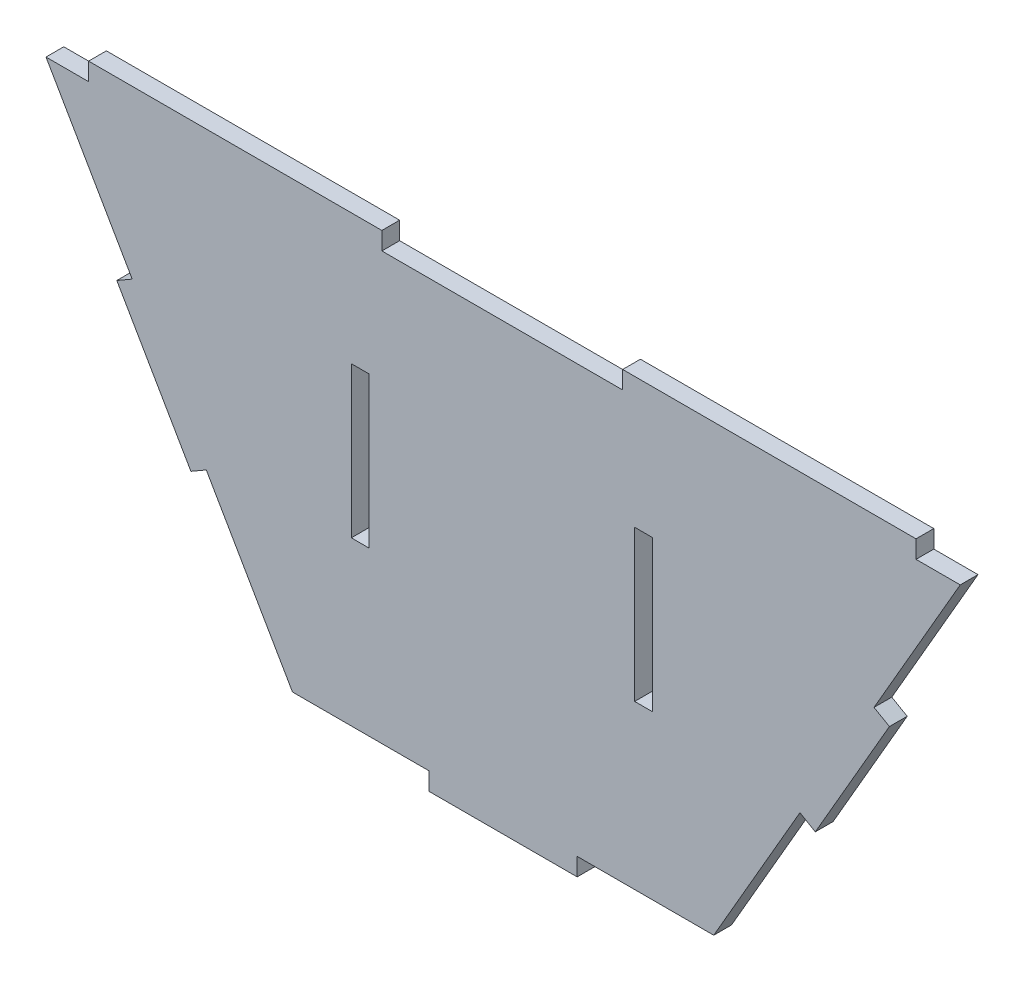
ISO-10303-21;
HEADER;
FILE_DESCRIPTION(('STEP AP214'),'2;1');
FILE_NAME('part.step','',(''),(''),'','','');
FILE_SCHEMA(('AUTOMOTIVE_DESIGN { 1 0 10303 214 1 1 1 1 }'));
ENDSEC;
DATA;
#1=APPLICATION_CONTEXT('core data for automotive mechanical design processes');
#2=APPLICATION_PROTOCOL_DEFINITION('international standard','automotive_design',2000,#1);
#3=PRODUCT_CONTEXT('',#1,'mechanical');
#4=PRODUCT('Part','Part','',(#3));
#5=PRODUCT_RELATED_PRODUCT_CATEGORY('part','',(#4));
#6=PRODUCT_DEFINITION_FORMATION('','',#4);
#7=PRODUCT_DEFINITION_CONTEXT('part definition',#1,'design');
#8=PRODUCT_DEFINITION('design','',#6,#7);
#9=PRODUCT_DEFINITION_SHAPE('','',#8);
#10=(LENGTH_UNIT() NAMED_UNIT(*) SI_UNIT(.MILLI.,.METRE.));
#11=(NAMED_UNIT(*) PLANE_ANGLE_UNIT() SI_UNIT($,.RADIAN.));
#12=(NAMED_UNIT(*) SI_UNIT($,.STERADIAN.) SOLID_ANGLE_UNIT());
#13=UNCERTAINTY_MEASURE_WITH_UNIT(LENGTH_MEASURE(1.E-05),#10,'distance_accuracy_value','');
#14=(GEOMETRIC_REPRESENTATION_CONTEXT(3) GLOBAL_UNCERTAINTY_ASSIGNED_CONTEXT((#13)) GLOBAL_UNIT_ASSIGNED_CONTEXT((#10,
#11,#12)) REPRESENTATION_CONTEXT('',''));
#15=CARTESIAN_POINT('',(0.,0.,0.));
#16=DIRECTION('',(0.,0.,1.));
#17=DIRECTION('',(1.,0.,0.));
#18=AXIS2_PLACEMENT_3D('',#15,#16,#17);
#19=CARTESIAN_POINT('',(0.,0.,1.524));
#20=DIRECTION('',(0.,0.,1.));
#21=DIRECTION('',(1.,0.,0.));
#22=AXIS2_PLACEMENT_3D('',#19,#20,#21);
#23=PLANE('',#22);
#24=DIRECTION('',(1.,0.,0.));
#25=VECTOR('',#24,1.);
#26=CARTESIAN_POINT('',(-13.0154243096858,-22.6139078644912,1.524));
#27=LINE('',#26,#25);
#28=CARTESIAN_POINT('',(-13.0154243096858,-22.6139078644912,1.524));
#29=VERTEX_POINT('',#28);
#30=CARTESIAN_POINT('',(-11.4914243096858,-22.6139078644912,1.524));
#31=VERTEX_POINT('',#30);
#32=EDGE_CURVE('E281',#29,#31,#27,.T.);
#33=ORIENTED_EDGE('',*,*,#32,.F.);
#34=DIRECTION('',(0.,-1.,0.));
#35=VECTOR('',#34,1.);
#36=CARTESIAN_POINT('',(-13.0154243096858,-22.6139078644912,1.524));
#37=LINE('',#36,#35);
#38=CARTESIAN_POINT('',(-13.0154243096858,-9.67997937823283,1.524));
#39=VERTEX_POINT('',#38);
#40=EDGE_CURVE('E279',#39,#29,#37,.T.);
#41=ORIENTED_EDGE('',*,*,#40,.F.);
#42=DIRECTION('',(-1.,0.,0.));
#43=VECTOR('',#42,1.);
#44=CARTESIAN_POINT('',(-13.0154243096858,-9.67997937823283,1.524));
#45=LINE('',#44,#43);
#46=CARTESIAN_POINT('',(-11.4914243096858,-9.67997937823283,1.524));
#47=VERTEX_POINT('',#46);
#48=EDGE_CURVE('E287',#47,#39,#45,.T.);
#49=ORIENTED_EDGE('',*,*,#48,.F.);
#50=DIRECTION('',(0.,1.,0.));
#51=VECTOR('',#50,1.);
#52=CARTESIAN_POINT('',(-11.4914243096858,-22.6139078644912,1.524));
#53=LINE('',#52,#51);
#54=EDGE_CURVE('E284',#31,#47,#53,.T.);
#55=ORIENTED_EDGE('',*,*,#54,.F.);
#56=EDGE_LOOP('',(#33,#41,#49,#55));
#57=FACE_BOUND('',#56,.T.);
#58=DIRECTION('',(-1.,0.,0.));
#59=VECTOR('',#58,1.);
#60=CARTESIAN_POINT('',(-35.5427068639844,0.,1.524));
#61=LINE('',#60,#59);
#62=CARTESIAN_POINT('',(-35.5427068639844,0.,1.524));
#63=VERTEX_POINT('',#62);
#64=CARTESIAN_POINT('',(-39.1954700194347,0.,1.524));
#65=VERTEX_POINT('',#64);
#66=EDGE_CURVE('E310',#63,#65,#61,.T.);
#67=ORIENTED_EDGE('',*,*,#66,.T.);
#68=DIRECTION('',(0.500229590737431,-0.865892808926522,0.));
#69=VECTOR('',#68,1.);
#70=CARTESIAN_POINT('',(-39.1954700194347,0.,1.524));
#71=LINE('',#70,#69);
#72=CARTESIAN_POINT('',(-31.8042349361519,-12.7941597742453,1.524));
#73=VERTEX_POINT('',#72);
#74=EDGE_CURVE('E313',#65,#73,#71,.T.);
#75=ORIENTED_EDGE('',*,*,#74,.T.);
#76=DIRECTION('',(-0.865892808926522,-0.50022959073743,0.));
#77=VECTOR('',#76,1.);
#78=CARTESIAN_POINT('',(-31.8042349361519,-12.7941597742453,1.524));
#79=LINE('',#78,#77);
#80=CARTESIAN_POINT('',(-33.1238555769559,-13.5565096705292,1.524));
#81=VERTEX_POINT('',#80);
#82=EDGE_CURVE('E316',#73,#81,#79,.T.);
#83=ORIENTED_EDGE('',*,*,#82,.T.);
#84=DIRECTION('',(0.500229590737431,-0.865892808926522,0.));
#85=VECTOR('',#84,1.);
#86=CARTESIAN_POINT('',(-33.1238555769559,-13.5565096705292,1.524));
#87=LINE('',#86,#85);
#88=CARTESIAN_POINT('',(-26.7709397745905,-24.553348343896,1.524));
#89=VERTEX_POINT('',#88);
#90=EDGE_CURVE('E318',#81,#89,#87,.T.);
#91=ORIENTED_EDGE('',*,*,#90,.T.);
#92=DIRECTION('',(0.865892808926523,0.50022959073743,0.));
#93=VECTOR('',#92,1.);
#94=CARTESIAN_POINT('',(-25.4513191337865,-23.7909984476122,1.524));
#95=LINE('',#94,#93);
#96=CARTESIAN_POINT('',(-25.4513191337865,-23.7909984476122,1.524));
#97=VERTEX_POINT('',#96);
#98=EDGE_CURVE('E320',#89,#97,#95,.T.);
#99=ORIENTED_EDGE('',*,*,#98,.T.);
#100=DIRECTION('',(0.500229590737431,-0.865892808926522,0.));
#101=VECTOR('',#100,1.);
#102=CARTESIAN_POINT('',(-25.4513191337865,-23.7909984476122,1.524));
#103=LINE('',#102,#101);
#104=CARTESIAN_POINT('',(-18.0600840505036,-36.5851582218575,1.524));
#105=VERTEX_POINT('',#104);
#106=EDGE_CURVE('E322',#97,#105,#103,.T.);
#107=ORIENTED_EDGE('',*,*,#106,.T.);
#108=DIRECTION('',(1.,0.,0.));
#109=VECTOR('',#108,1.);
#110=CARTESIAN_POINT('',(-18.0600840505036,-36.5851582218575,1.524));
#111=LINE('',#110,#109);
#112=CARTESIAN_POINT('',(-6.35,-36.5851582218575,1.524));
#113=VERTEX_POINT('',#112);
#114=EDGE_CURVE('E324',#105,#113,#111,.T.);
#115=ORIENTED_EDGE('',*,*,#114,.T.);
#116=DIRECTION('',(0.,-1.,0.));
#117=VECTOR('',#116,1.);
#118=CARTESIAN_POINT('',(-6.35,-36.5851582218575,1.524));
#119=LINE('',#118,#117);
#120=CARTESIAN_POINT('',(-6.35,-38.1091582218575,1.524));
#121=VERTEX_POINT('',#120);
#122=EDGE_CURVE('E326',#113,#121,#119,.T.);
#123=ORIENTED_EDGE('',*,*,#122,.T.);
#124=DIRECTION('',(1.,0.,0.));
#125=VECTOR('',#124,1.);
#126=CARTESIAN_POINT('',(-6.35,-38.1091582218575,1.524));
#127=LINE('',#126,#125);
#128=CARTESIAN_POINT('',(6.35,-38.1091582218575,1.524));
#129=VERTEX_POINT('',#128);
#130=EDGE_CURVE('E328',#121,#129,#127,.T.);
#131=ORIENTED_EDGE('',*,*,#130,.T.);
#132=DIRECTION('',(0.,1.,0.));
#133=VECTOR('',#132,1.);
#134=CARTESIAN_POINT('',(6.35,-36.5851582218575,1.524));
#135=LINE('',#134,#133);
#136=CARTESIAN_POINT('',(6.35,-36.5851582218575,1.524));
#137=VERTEX_POINT('',#136);
#138=EDGE_CURVE('E330',#129,#137,#135,.T.);
#139=ORIENTED_EDGE('',*,*,#138,.T.);
#140=DIRECTION('',(1.,0.,0.));
#141=VECTOR('',#140,1.);
#142=CARTESIAN_POINT('',(6.35,-36.5851582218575,1.524));
#143=LINE('',#142,#141);
#144=CARTESIAN_POINT('',(18.0600840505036,-36.5851582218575,1.524));
#145=VERTEX_POINT('',#144);
#146=EDGE_CURVE('E332',#137,#145,#143,.T.);
#147=ORIENTED_EDGE('',*,*,#146,.T.);
#148=DIRECTION('',(0.500229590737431,0.865892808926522,0.));
#149=VECTOR('',#148,1.);
#150=CARTESIAN_POINT('',(25.4513191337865,-23.7909984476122,1.524));
#151=LINE('',#150,#149);
#152=CARTESIAN_POINT('',(25.4513191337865,-23.7909984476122,1.524));
#153=VERTEX_POINT('',#152);
#154=EDGE_CURVE('E334',#145,#153,#151,.T.);
#155=ORIENTED_EDGE('',*,*,#154,.T.);
#156=DIRECTION('',(0.865892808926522,-0.500229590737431,0.));
#157=VECTOR('',#156,1.);
#158=CARTESIAN_POINT('',(25.4513191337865,-23.7909984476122,1.524));
#159=LINE('',#158,#157);
#160=CARTESIAN_POINT('',(26.7709397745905,-24.553348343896,1.524));
#161=VERTEX_POINT('',#160);
#162=EDGE_CURVE('E336',#153,#161,#159,.T.);
#163=ORIENTED_EDGE('',*,*,#162,.T.);
#164=DIRECTION('',(0.500229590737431,0.865892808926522,0.));
#165=VECTOR('',#164,1.);
#166=CARTESIAN_POINT('',(26.7709397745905,-24.553348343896,1.524));
#167=LINE('',#166,#165);
#168=CARTESIAN_POINT('',(33.1238555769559,-13.5565096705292,1.524));
#169=VERTEX_POINT('',#168);
#170=EDGE_CURVE('E338',#161,#169,#167,.T.);
#171=ORIENTED_EDGE('',*,*,#170,.T.);
#172=DIRECTION('',(-0.865892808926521,0.500229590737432,0.));
#173=VECTOR('',#172,1.);
#174=CARTESIAN_POINT('',(31.8042349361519,-12.7941597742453,1.524));
#175=LINE('',#174,#173);
#176=CARTESIAN_POINT('',(31.8042349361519,-12.7941597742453,1.524));
#177=VERTEX_POINT('',#176);
#178=EDGE_CURVE('E340',#169,#177,#175,.T.);
#179=ORIENTED_EDGE('',*,*,#178,.T.);
#180=DIRECTION('',(0.500229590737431,0.865892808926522,0.));
#181=VECTOR('',#180,1.);
#182=CARTESIAN_POINT('',(39.1954700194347,0.,1.524));
#183=LINE('',#182,#181);
#184=CARTESIAN_POINT('',(39.1954700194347,0.,1.524));
#185=VERTEX_POINT('',#184);
#186=EDGE_CURVE('E342',#177,#185,#183,.T.);
#187=ORIENTED_EDGE('',*,*,#186,.T.);
#188=DIRECTION('',(-1.,0.,0.));
#189=VECTOR('',#188,1.);
#190=CARTESIAN_POINT('',(35.4052426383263,0.,1.524));
#191=LINE('',#190,#189);
#192=CARTESIAN_POINT('',(35.4052426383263,0.,1.524));
#193=VERTEX_POINT('',#192);
#194=EDGE_CURVE('E344',#185,#193,#191,.T.);
#195=ORIENTED_EDGE('',*,*,#194,.T.);
#196=DIRECTION('',(0.,1.,0.));
#197=VECTOR('',#196,1.);
#198=CARTESIAN_POINT('',(35.4052426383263,0.,1.524));
#199=LINE('',#198,#197);
#200=CARTESIAN_POINT('',(35.4052426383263,1.524,1.524));
#201=VERTEX_POINT('',#200);
#202=EDGE_CURVE('E346',#193,#201,#199,.T.);
#203=ORIENTED_EDGE('',*,*,#202,.T.);
#204=DIRECTION('',(-1.,0.,0.));
#205=VECTOR('',#204,1.);
#206=CARTESIAN_POINT('',(10.2511639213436,1.524,1.524));
#207=LINE('',#206,#205);
#208=CARTESIAN_POINT('',(10.2511639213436,1.524,1.524));
#209=VERTEX_POINT('',#208);
#210=EDGE_CURVE('E348',#201,#209,#207,.T.);
#211=ORIENTED_EDGE('',*,*,#210,.T.);
#212=DIRECTION('',(0.,-1.,0.));
#213=VECTOR('',#212,1.);
#214=CARTESIAN_POINT('',(10.2511639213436,0.,1.524));
#215=LINE('',#214,#213);
#216=CARTESIAN_POINT('',(10.2511639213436,0.,1.524));
#217=VERTEX_POINT('',#216);
#218=EDGE_CURVE('E350',#209,#217,#215,.T.);
#219=ORIENTED_EDGE('',*,*,#218,.T.);
#220=DIRECTION('',(-1.,0.,0.));
#221=VECTOR('',#220,1.);
#222=CARTESIAN_POINT('',(-10.3967007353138,0.,1.524));
#223=LINE('',#222,#221);
#224=CARTESIAN_POINT('',(-10.3967007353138,0.,1.524));
#225=VERTEX_POINT('',#224);
#226=EDGE_CURVE('E352',#217,#225,#223,.T.);
#227=ORIENTED_EDGE('',*,*,#226,.T.);
#228=DIRECTION('',(0.,1.,0.));
#229=VECTOR('',#228,1.);
#230=CARTESIAN_POINT('',(-10.3967007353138,1.524,1.524));
#231=LINE('',#230,#229);
#232=CARTESIAN_POINT('',(-10.3967007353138,1.524,1.524));
#233=VERTEX_POINT('',#232);
#234=EDGE_CURVE('E354',#225,#233,#231,.T.);
#235=ORIENTED_EDGE('',*,*,#234,.T.);
#236=DIRECTION('',(-1.,0.,0.));
#237=VECTOR('',#236,1.);
#238=CARTESIAN_POINT('',(-35.5427068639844,1.524,1.524));
#239=LINE('',#238,#237);
#240=CARTESIAN_POINT('',(-35.5427068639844,1.524,1.524));
#241=VERTEX_POINT('',#240);
#242=EDGE_CURVE('E356',#233,#241,#239,.T.);
#243=ORIENTED_EDGE('',*,*,#242,.T.);
#244=DIRECTION('',(0.,-1.,0.));
#245=VECTOR('',#244,1.);
#246=CARTESIAN_POINT('',(-35.5427068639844,0.,1.524));
#247=LINE('',#246,#245);
#248=EDGE_CURVE('E358',#241,#63,#247,.T.);
#249=ORIENTED_EDGE('',*,*,#248,.T.);
#250=EDGE_LOOP('',(#67,#75,#83,#91,#99,#107,#115,#123,#131,#139,#147,#155,#163,#171,#179,#187,
#195,#203,#211,#219,#227,#235,#243,#249));
#251=FACE_BOUND('',#250,.T.);
#252=DIRECTION('',(0.,1.,0.));
#253=VECTOR('',#252,1.);
#254=CARTESIAN_POINT('',(12.8033190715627,-22.6139078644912,1.524));
#255=LINE('',#254,#253);
#256=CARTESIAN_POINT('',(12.8033190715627,-22.6139078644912,1.524));
#257=VERTEX_POINT('',#256);
#258=CARTESIAN_POINT('',(12.8033190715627,-9.67997937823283,1.524));
#259=VERTEX_POINT('',#258);
#260=EDGE_CURVE('E251',#257,#259,#255,.T.);
#261=ORIENTED_EDGE('',*,*,#260,.F.);
#262=DIRECTION('',(1.,0.,0.));
#263=VECTOR('',#262,1.);
#264=CARTESIAN_POINT('',(12.8033190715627,-22.6139078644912,1.524));
#265=LINE('',#264,#263);
#266=CARTESIAN_POINT('',(11.2793190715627,-22.6139078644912,1.524));
#267=VERTEX_POINT('',#266);
#268=EDGE_CURVE('E243',#267,#257,#265,.T.);
#269=ORIENTED_EDGE('',*,*,#268,.F.);
#270=DIRECTION('',(0.,-1.,0.));
#271=VECTOR('',#270,1.);
#272=CARTESIAN_POINT('',(11.2793190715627,-22.6139078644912,1.524));
#273=LINE('',#272,#271);
#274=CARTESIAN_POINT('',(11.2793190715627,-9.67997937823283,1.524));
#275=VERTEX_POINT('',#274);
#276=EDGE_CURVE('E265',#275,#267,#273,.T.);
#277=ORIENTED_EDGE('',*,*,#276,.F.);
#278=DIRECTION('',(-1.,0.,0.));
#279=VECTOR('',#278,1.);
#280=CARTESIAN_POINT('',(12.8033190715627,-9.67997937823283,1.524));
#281=LINE('',#280,#279);
#282=EDGE_CURVE('E263',#259,#275,#281,.T.);
#283=ORIENTED_EDGE('',*,*,#282,.F.);
#284=EDGE_LOOP('',(#261,#269,#277,#283));
#285=FACE_BOUND('',#284,.T.);
#286=ADVANCED_FACE('F34',(#57,#251,#285),#23,.T.);
#287=CARTESIAN_POINT('',(0.,0.,0.));
#288=DIRECTION('',(0.,0.,1.));
#289=DIRECTION('',(1.,0.,0.));
#290=AXIS2_PLACEMENT_3D('',#287,#288,#289);
#291=PLANE('',#290);
#292=DIRECTION('',(0.,-1.,0.));
#293=VECTOR('',#292,1.);
#294=CARTESIAN_POINT('',(-13.0154243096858,-22.6139078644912,0.));
#295=LINE('',#294,#293);
#296=CARTESIAN_POINT('',(-13.0154243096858,-9.67997937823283,0.));
#297=VERTEX_POINT('',#296);
#298=CARTESIAN_POINT('',(-13.0154243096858,-22.6139078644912,0.));
#299=VERTEX_POINT('',#298);
#300=EDGE_CURVE('E259',#297,#299,#295,.T.);
#301=ORIENTED_EDGE('',*,*,#300,.T.);
#302=DIRECTION('',(1.,0.,0.));
#303=VECTOR('',#302,1.);
#304=CARTESIAN_POINT('',(-13.0154243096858,-22.6139078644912,0.));
#305=LINE('',#304,#303);
#306=CARTESIAN_POINT('',(-11.4914243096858,-22.6139078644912,0.));
#307=VERTEX_POINT('',#306);
#308=EDGE_CURVE('E292',#299,#307,#305,.T.);
#309=ORIENTED_EDGE('',*,*,#308,.T.);
#310=DIRECTION('',(0.,1.,0.));
#311=VECTOR('',#310,1.);
#312=CARTESIAN_POINT('',(-11.4914243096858,-22.6139078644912,0.));
#313=LINE('',#312,#311);
#314=CARTESIAN_POINT('',(-11.4914243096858,-9.67997937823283,0.));
#315=VERTEX_POINT('',#314);
#316=EDGE_CURVE('E295',#307,#315,#313,.T.);
#317=ORIENTED_EDGE('',*,*,#316,.T.);
#318=DIRECTION('',(-1.,0.,0.));
#319=VECTOR('',#318,1.);
#320=CARTESIAN_POINT('',(-13.0154243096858,-9.67997937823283,0.));
#321=LINE('',#320,#319);
#322=EDGE_CURVE('E282',#315,#297,#321,.T.);
#323=ORIENTED_EDGE('',*,*,#322,.T.);
#324=EDGE_LOOP('',(#301,#309,#317,#323));
#325=FACE_BOUND('',#324,.T.);
#326=DIRECTION('',(-1.,0.,0.));
#327=VECTOR('',#326,1.);
#328=CARTESIAN_POINT('',(-35.5427068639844,0.,0.));
#329=LINE('',#328,#327);
#330=CARTESIAN_POINT('',(-35.5427068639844,0.,0.));
#331=VERTEX_POINT('',#330);
#332=CARTESIAN_POINT('',(-39.1954700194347,0.,0.));
#333=VERTEX_POINT('',#332);
#334=EDGE_CURVE('E309',#331,#333,#329,.T.);
#335=ORIENTED_EDGE('',*,*,#334,.F.);
#336=DIRECTION('',(0.,-1.,0.));
#337=VECTOR('',#336,1.);
#338=CARTESIAN_POINT('',(-35.5427068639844,0.,0.));
#339=LINE('',#338,#337);
#340=CARTESIAN_POINT('',(-35.5427068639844,1.524,0.));
#341=VERTEX_POINT('',#340);
#342=EDGE_CURVE('E314',#341,#331,#339,.T.);
#343=ORIENTED_EDGE('',*,*,#342,.F.);
#344=DIRECTION('',(-1.,0.,0.));
#345=VECTOR('',#344,1.);
#346=CARTESIAN_POINT('',(-35.5427068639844,1.524,0.));
#347=LINE('',#346,#345);
#348=CARTESIAN_POINT('',(-10.3967007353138,1.524,0.));
#349=VERTEX_POINT('',#348);
#350=EDGE_CURVE('E405',#349,#341,#347,.T.);
#351=ORIENTED_EDGE('',*,*,#350,.F.);
#352=DIRECTION('',(0.,1.,0.));
#353=VECTOR('',#352,1.);
#354=CARTESIAN_POINT('',(-10.3967007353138,1.524,0.));
#355=LINE('',#354,#353);
#356=CARTESIAN_POINT('',(-10.3967007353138,0.,0.));
#357=VERTEX_POINT('',#356);
#358=EDGE_CURVE('E403',#357,#349,#355,.T.);
#359=ORIENTED_EDGE('',*,*,#358,.F.);
#360=DIRECTION('',(-1.,0.,0.));
#361=VECTOR('',#360,1.);
#362=CARTESIAN_POINT('',(-10.3967007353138,0.,0.));
#363=LINE('',#362,#361);
#364=CARTESIAN_POINT('',(10.2511639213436,0.,0.));
#365=VERTEX_POINT('',#364);
#366=EDGE_CURVE('E401',#365,#357,#363,.T.);
#367=ORIENTED_EDGE('',*,*,#366,.F.);
#368=DIRECTION('',(0.,-1.,0.));
#369=VECTOR('',#368,1.);
#370=CARTESIAN_POINT('',(10.2511639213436,0.,0.));
#371=LINE('',#370,#369);
#372=CARTESIAN_POINT('',(10.2511639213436,1.524,0.));
#373=VERTEX_POINT('',#372);
#374=EDGE_CURVE('E399',#373,#365,#371,.T.);
#375=ORIENTED_EDGE('',*,*,#374,.F.);
#376=DIRECTION('',(-1.,0.,0.));
#377=VECTOR('',#376,1.);
#378=CARTESIAN_POINT('',(10.2511639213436,1.524,0.));
#379=LINE('',#378,#377);
#380=CARTESIAN_POINT('',(35.4052426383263,1.524,0.));
#381=VERTEX_POINT('',#380);
#382=EDGE_CURVE('E397',#381,#373,#379,.T.);
#383=ORIENTED_EDGE('',*,*,#382,.F.);
#384=DIRECTION('',(0.,1.,0.));
#385=VECTOR('',#384,1.);
#386=CARTESIAN_POINT('',(35.4052426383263,0.,0.));
#387=LINE('',#386,#385);
#388=CARTESIAN_POINT('',(35.4052426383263,0.,0.));
#389=VERTEX_POINT('',#388);
#390=EDGE_CURVE('E395',#389,#381,#387,.T.);
#391=ORIENTED_EDGE('',*,*,#390,.F.);
#392=DIRECTION('',(-1.,0.,0.));
#393=VECTOR('',#392,1.);
#394=CARTESIAN_POINT('',(35.4052426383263,0.,0.));
#395=LINE('',#394,#393);
#396=CARTESIAN_POINT('',(39.1954700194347,0.,0.));
#397=VERTEX_POINT('',#396);
#398=EDGE_CURVE('E393',#397,#389,#395,.T.);
#399=ORIENTED_EDGE('',*,*,#398,.F.);
#400=DIRECTION('',(0.500229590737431,0.865892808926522,0.));
#401=VECTOR('',#400,1.);
#402=CARTESIAN_POINT('',(39.1954700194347,0.,0.));
#403=LINE('',#402,#401);
#404=CARTESIAN_POINT('',(31.8042349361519,-12.7941597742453,0.));
#405=VERTEX_POINT('',#404);
#406=EDGE_CURVE('E391',#405,#397,#403,.T.);
#407=ORIENTED_EDGE('',*,*,#406,.F.);
#408=DIRECTION('',(-0.865892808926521,0.500229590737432,0.));
#409=VECTOR('',#408,1.);
#410=CARTESIAN_POINT('',(31.8042349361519,-12.7941597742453,0.));
#411=LINE('',#410,#409);
#412=CARTESIAN_POINT('',(33.1238555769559,-13.5565096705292,0.));
#413=VERTEX_POINT('',#412);
#414=EDGE_CURVE('E389',#413,#405,#411,.T.);
#415=ORIENTED_EDGE('',*,*,#414,.F.);
#416=DIRECTION('',(0.500229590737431,0.865892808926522,0.));
#417=VECTOR('',#416,1.);
#418=CARTESIAN_POINT('',(26.7709397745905,-24.553348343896,0.));
#419=LINE('',#418,#417);
#420=CARTESIAN_POINT('',(26.7709397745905,-24.553348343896,0.));
#421=VERTEX_POINT('',#420);
#422=EDGE_CURVE('E387',#421,#413,#419,.T.);
#423=ORIENTED_EDGE('',*,*,#422,.F.);
#424=DIRECTION('',(0.865892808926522,-0.500229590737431,0.));
#425=VECTOR('',#424,1.);
#426=CARTESIAN_POINT('',(25.4513191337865,-23.7909984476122,0.));
#427=LINE('',#426,#425);
#428=CARTESIAN_POINT('',(25.4513191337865,-23.7909984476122,0.));
#429=VERTEX_POINT('',#428);
#430=EDGE_CURVE('E385',#429,#421,#427,.T.);
#431=ORIENTED_EDGE('',*,*,#430,.F.);
#432=DIRECTION('',(0.500229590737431,0.865892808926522,0.));
#433=VECTOR('',#432,1.);
#434=CARTESIAN_POINT('',(25.4513191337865,-23.7909984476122,0.));
#435=LINE('',#434,#433);
#436=CARTESIAN_POINT('',(18.0600840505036,-36.5851582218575,0.));
#437=VERTEX_POINT('',#436);
#438=EDGE_CURVE('E383',#437,#429,#435,.T.);
#439=ORIENTED_EDGE('',*,*,#438,.F.);
#440=DIRECTION('',(1.,0.,0.));
#441=VECTOR('',#440,1.);
#442=CARTESIAN_POINT('',(6.35,-36.5851582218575,0.));
#443=LINE('',#442,#441);
#444=CARTESIAN_POINT('',(6.35,-36.5851582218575,0.));
#445=VERTEX_POINT('',#444);
#446=EDGE_CURVE('E381',#445,#437,#443,.T.);
#447=ORIENTED_EDGE('',*,*,#446,.F.);
#448=DIRECTION('',(0.,1.,0.));
#449=VECTOR('',#448,1.);
#450=CARTESIAN_POINT('',(6.35,-36.5851582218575,0.));
#451=LINE('',#450,#449);
#452=CARTESIAN_POINT('',(6.35,-38.1091582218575,0.));
#453=VERTEX_POINT('',#452);
#454=EDGE_CURVE('E379',#453,#445,#451,.T.);
#455=ORIENTED_EDGE('',*,*,#454,.F.);
#456=DIRECTION('',(1.,0.,0.));
#457=VECTOR('',#456,1.);
#458=CARTESIAN_POINT('',(-6.35,-38.1091582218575,0.));
#459=LINE('',#458,#457);
#460=CARTESIAN_POINT('',(-6.35,-38.1091582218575,0.));
#461=VERTEX_POINT('',#460);
#462=EDGE_CURVE('E377',#461,#453,#459,.T.);
#463=ORIENTED_EDGE('',*,*,#462,.F.);
#464=DIRECTION('',(0.,-1.,0.));
#465=VECTOR('',#464,1.);
#466=CARTESIAN_POINT('',(-6.35,-36.5851582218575,0.));
#467=LINE('',#466,#465);
#468=CARTESIAN_POINT('',(-6.35,-36.5851582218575,0.));
#469=VERTEX_POINT('',#468);
#470=EDGE_CURVE('E375',#469,#461,#467,.T.);
#471=ORIENTED_EDGE('',*,*,#470,.F.);
#472=DIRECTION('',(1.,0.,0.));
#473=VECTOR('',#472,1.);
#474=CARTESIAN_POINT('',(-18.0600840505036,-36.5851582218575,0.));
#475=LINE('',#474,#473);
#476=CARTESIAN_POINT('',(-18.0600840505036,-36.5851582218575,0.));
#477=VERTEX_POINT('',#476);
#478=EDGE_CURVE('E373',#477,#469,#475,.T.);
#479=ORIENTED_EDGE('',*,*,#478,.F.);
#480=DIRECTION('',(0.500229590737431,-0.865892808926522,0.));
#481=VECTOR('',#480,1.);
#482=CARTESIAN_POINT('',(-25.4513191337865,-23.7909984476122,0.));
#483=LINE('',#482,#481);
#484=CARTESIAN_POINT('',(-25.4513191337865,-23.7909984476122,0.));
#485=VERTEX_POINT('',#484);
#486=EDGE_CURVE('E371',#485,#477,#483,.T.);
#487=ORIENTED_EDGE('',*,*,#486,.F.);
#488=DIRECTION('',(0.865892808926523,0.50022959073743,0.));
#489=VECTOR('',#488,1.);
#490=CARTESIAN_POINT('',(-25.4513191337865,-23.7909984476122,0.));
#491=LINE('',#490,#489);
#492=CARTESIAN_POINT('',(-26.7709397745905,-24.553348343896,0.));
#493=VERTEX_POINT('',#492);
#494=EDGE_CURVE('E369',#493,#485,#491,.T.);
#495=ORIENTED_EDGE('',*,*,#494,.F.);
#496=DIRECTION('',(0.500229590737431,-0.865892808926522,0.));
#497=VECTOR('',#496,1.);
#498=CARTESIAN_POINT('',(-33.1238555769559,-13.5565096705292,0.));
#499=LINE('',#498,#497);
#500=CARTESIAN_POINT('',(-33.1238555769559,-13.5565096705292,0.));
#501=VERTEX_POINT('',#500);
#502=EDGE_CURVE('E367',#501,#493,#499,.T.);
#503=ORIENTED_EDGE('',*,*,#502,.F.);
#504=DIRECTION('',(-0.865892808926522,-0.50022959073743,0.));
#505=VECTOR('',#504,1.);
#506=CARTESIAN_POINT('',(-31.8042349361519,-12.7941597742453,0.));
#507=LINE('',#506,#505);
#508=CARTESIAN_POINT('',(-31.8042349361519,-12.7941597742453,0.));
#509=VERTEX_POINT('',#508);
#510=EDGE_CURVE('E365',#509,#501,#507,.T.);
#511=ORIENTED_EDGE('',*,*,#510,.F.);
#512=DIRECTION('',(0.500229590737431,-0.865892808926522,0.));
#513=VECTOR('',#512,1.);
#514=CARTESIAN_POINT('',(-39.1954700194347,0.,0.));
#515=LINE('',#514,#513);
#516=EDGE_CURVE('E363',#333,#509,#515,.T.);
#517=ORIENTED_EDGE('',*,*,#516,.F.);
#518=EDGE_LOOP('',(#335,#343,#351,#359,#367,#375,#383,#391,#399,#407,#415,#423,#431,#439,#447,
#455,#463,#471,#479,#487,#495,#503,#511,#517));
#519=FACE_BOUND('',#518,.T.);
#520=DIRECTION('',(1.,0.,0.));
#521=VECTOR('',#520,1.);
#522=CARTESIAN_POINT('',(12.8033190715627,-22.6139078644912,0.));
#523=LINE('',#522,#521);
#524=CARTESIAN_POINT('',(11.2793190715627,-22.6139078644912,0.));
#525=VERTEX_POINT('',#524);
#526=CARTESIAN_POINT('',(12.8033190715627,-22.6139078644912,0.));
#527=VERTEX_POINT('',#526);
#528=EDGE_CURVE('E57',#525,#527,#523,.T.);
#529=ORIENTED_EDGE('',*,*,#528,.T.);
#530=DIRECTION('',(0.,1.,0.));
#531=VECTOR('',#530,1.);
#532=CARTESIAN_POINT('',(12.8033190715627,-22.6139078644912,0.));
#533=LINE('',#532,#531);
#534=CARTESIAN_POINT('',(12.8033190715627,-9.67997937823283,0.));
#535=VERTEX_POINT('',#534);
#536=EDGE_CURVE('E258',#527,#535,#533,.T.);
#537=ORIENTED_EDGE('',*,*,#536,.T.);
#538=DIRECTION('',(-1.,0.,0.));
#539=VECTOR('',#538,1.);
#540=CARTESIAN_POINT('',(12.8033190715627,-9.67997937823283,0.));
#541=LINE('',#540,#539);
#542=CARTESIAN_POINT('',(11.2793190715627,-9.67997937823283,0.));
#543=VERTEX_POINT('',#542);
#544=EDGE_CURVE('E271',#535,#543,#541,.T.);
#545=ORIENTED_EDGE('',*,*,#544,.T.);
#546=DIRECTION('',(0.,-1.,0.));
#547=VECTOR('',#546,1.);
#548=CARTESIAN_POINT('',(11.2793190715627,-22.6139078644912,0.));
#549=LINE('',#548,#547);
#550=EDGE_CURVE('E252',#543,#525,#549,.T.);
#551=ORIENTED_EDGE('',*,*,#550,.T.);
#552=EDGE_LOOP('',(#529,#537,#545,#551));
#553=FACE_BOUND('',#552,.T.);
#554=ADVANCED_FACE('F483',(#325,#519,#553),#291,.F.);
#555=CARTESIAN_POINT('',(-35.5427068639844,0.,1.524));
#556=DIRECTION('',(0.,-1.,0.));
#557=DIRECTION('',(0.,0.,-1.));
#558=AXIS2_PLACEMENT_3D('',#555,#556,#557);
#559=PLANE('',#558);
#560=ORIENTED_EDGE('',*,*,#334,.T.);
#561=DIRECTION('',(0.,0.,-1.));
#562=VECTOR('',#561,1.);
#563=CARTESIAN_POINT('',(-39.1954700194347,0.,1.524));
#564=LINE('',#563,#562);
#565=EDGE_CURVE('E11',#65,#333,#564,.T.);
#566=ORIENTED_EDGE('',*,*,#565,.F.);
#567=ORIENTED_EDGE('',*,*,#66,.F.);
#568=DIRECTION('',(0.,0.,-1.));
#569=VECTOR('',#568,1.);
#570=CARTESIAN_POINT('',(-35.5427068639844,0.,1.524));
#571=LINE('',#570,#569);
#572=EDGE_CURVE('E360',#63,#331,#571,.T.);
#573=ORIENTED_EDGE('',*,*,#572,.T.);
#574=EDGE_LOOP('',(#560,#566,#567,#573));
#575=FACE_BOUND('',#574,.T.);
#576=ADVANCED_FACE('F36',(#575),#559,.F.);
#577=CARTESIAN_POINT('',(-39.1954700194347,0.,1.524));
#578=DIRECTION('',(0.865892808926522,0.500229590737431,0.));
#579=DIRECTION('',(-0.500229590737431,0.865892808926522,0.));
#580=AXIS2_PLACEMENT_3D('',#577,#578,#579);
#581=PLANE('',#580);
#582=ORIENTED_EDGE('',*,*,#516,.T.);
#583=DIRECTION('',(0.,0.,-1.));
#584=VECTOR('',#583,1.);
#585=CARTESIAN_POINT('',(-31.8042349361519,-12.7941597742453,1.524));
#586=LINE('',#585,#584);
#587=EDGE_CURVE('E42',#73,#509,#586,.T.);
#588=ORIENTED_EDGE('',*,*,#587,.F.);
#589=ORIENTED_EDGE('',*,*,#74,.F.);
#590=ORIENTED_EDGE('',*,*,#565,.T.);
#591=EDGE_LOOP('',(#582,#588,#589,#590));
#592=FACE_BOUND('',#591,.T.);
#593=ADVANCED_FACE('F500',(#592),#581,.F.);
#594=CARTESIAN_POINT('',(-31.8042349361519,-12.7941597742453,1.524));
#595=DIRECTION('',(0.50022959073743,-0.865892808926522,0.));
#596=DIRECTION('',(0.865892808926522,0.50022959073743,0.));
#597=AXIS2_PLACEMENT_3D('',#594,#595,#596);
#598=PLANE('',#597);
#599=ORIENTED_EDGE('',*,*,#510,.T.);
#600=DIRECTION('',(0.,0.,-1.));
#601=VECTOR('',#600,1.);
#602=CARTESIAN_POINT('',(-33.1238555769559,-13.5565096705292,1.524));
#603=LINE('',#602,#601);
#604=EDGE_CURVE('E470',#81,#501,#603,.T.);
#605=ORIENTED_EDGE('',*,*,#604,.F.);
#606=ORIENTED_EDGE('',*,*,#82,.F.);
#607=ORIENTED_EDGE('',*,*,#587,.T.);
#608=EDGE_LOOP('',(#599,#605,#606,#607));
#609=FACE_BOUND('',#608,.T.);
#610=ADVANCED_FACE('F477',(#609),#598,.F.);
#611=CARTESIAN_POINT('',(-33.1238555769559,-13.5565096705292,1.524));
#612=DIRECTION('',(0.865892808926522,0.500229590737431,0.));
#613=DIRECTION('',(-0.500229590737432,0.865892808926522,0.));
#614=AXIS2_PLACEMENT_3D('',#611,#612,#613);
#615=PLANE('',#614);
#616=ORIENTED_EDGE('',*,*,#502,.T.);
#617=DIRECTION('',(0.,0.,-1.));
#618=VECTOR('',#617,1.);
#619=CARTESIAN_POINT('',(-26.7709397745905,-24.553348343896,1.524));
#620=LINE('',#619,#618);
#621=EDGE_CURVE('E467',#89,#493,#620,.T.);
#622=ORIENTED_EDGE('',*,*,#621,.F.);
#623=ORIENTED_EDGE('',*,*,#90,.F.);
#624=ORIENTED_EDGE('',*,*,#604,.T.);
#625=EDGE_LOOP('',(#616,#622,#623,#624));
#626=FACE_BOUND('',#625,.T.);
#627=ADVANCED_FACE('F489',(#626),#615,.F.);
#628=CARTESIAN_POINT('',(-25.4513191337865,-23.7909984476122,1.524));
#629=DIRECTION('',(-0.50022959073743,0.865892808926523,0.));
#630=DIRECTION('',(-0.865892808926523,-0.50022959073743,0.));
#631=AXIS2_PLACEMENT_3D('',#628,#629,#630);
#632=PLANE('',#631);
#633=ORIENTED_EDGE('',*,*,#494,.T.);
#634=DIRECTION('',(0.,0.,-1.));
#635=VECTOR('',#634,1.);
#636=CARTESIAN_POINT('',(-25.4513191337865,-23.7909984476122,1.524));
#637=LINE('',#636,#635);
#638=EDGE_CURVE('E464',#97,#485,#637,.T.);
#639=ORIENTED_EDGE('',*,*,#638,.F.);
#640=ORIENTED_EDGE('',*,*,#98,.F.);
#641=ORIENTED_EDGE('',*,*,#621,.T.);
#642=EDGE_LOOP('',(#633,#639,#640,#641));
#643=FACE_BOUND('',#642,.T.);
#644=ADVANCED_FACE('F493',(#643),#632,.F.);
#645=CARTESIAN_POINT('',(-25.4513191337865,-23.7909984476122,1.524));
#646=DIRECTION('',(0.865892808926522,0.500229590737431,0.));
#647=DIRECTION('',(-0.500229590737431,0.865892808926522,0.));
#648=AXIS2_PLACEMENT_3D('',#645,#646,#647);
#649=PLANE('',#648);
#650=ORIENTED_EDGE('',*,*,#486,.T.);
#651=DIRECTION('',(0.,0.,-1.));
#652=VECTOR('',#651,1.);
#653=CARTESIAN_POINT('',(-18.0600840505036,-36.5851582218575,1.524));
#654=LINE('',#653,#652);
#655=EDGE_CURVE('E461',#105,#477,#654,.T.);
#656=ORIENTED_EDGE('',*,*,#655,.F.);
#657=ORIENTED_EDGE('',*,*,#106,.F.);
#658=ORIENTED_EDGE('',*,*,#638,.T.);
#659=EDGE_LOOP('',(#650,#656,#657,#658));
#660=FACE_BOUND('',#659,.T.);
#661=ADVANCED_FACE('F593',(#660),#649,.F.);
#662=CARTESIAN_POINT('',(-18.0600840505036,-36.5851582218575,1.524));
#663=DIRECTION('',(0.,1.,0.));
#664=DIRECTION('',(0.,0.,1.));
#665=AXIS2_PLACEMENT_3D('',#662,#663,#664);
#666=PLANE('',#665);
#667=ORIENTED_EDGE('',*,*,#478,.T.);
#668=DIRECTION('',(0.,0.,-1.));
#669=VECTOR('',#668,1.);
#670=CARTESIAN_POINT('',(-6.35,-36.5851582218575,1.524));
#671=LINE('',#670,#669);
#672=EDGE_CURVE('E458',#113,#469,#671,.T.);
#673=ORIENTED_EDGE('',*,*,#672,.F.);
#674=ORIENTED_EDGE('',*,*,#114,.F.);
#675=ORIENTED_EDGE('',*,*,#655,.T.);
#676=EDGE_LOOP('',(#667,#673,#674,#675));
#677=FACE_BOUND('',#676,.T.);
#678=ADVANCED_FACE('F591',(#677),#666,.F.);
#679=CARTESIAN_POINT('',(-6.35,-36.5851582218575,1.524));
#680=DIRECTION('',(1.,0.,0.));
#681=DIRECTION('',(0.,0.,-1.));
#682=AXIS2_PLACEMENT_3D('',#679,#680,#681);
#683=PLANE('',#682);
#684=ORIENTED_EDGE('',*,*,#470,.T.);
#685=DIRECTION('',(0.,0.,-1.));
#686=VECTOR('',#685,1.);
#687=CARTESIAN_POINT('',(-6.35,-38.1091582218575,1.524));
#688=LINE('',#687,#686);
#689=EDGE_CURVE('E455',#121,#461,#688,.T.);
#690=ORIENTED_EDGE('',*,*,#689,.F.);
#691=ORIENTED_EDGE('',*,*,#122,.F.);
#692=ORIENTED_EDGE('',*,*,#672,.T.);
#693=EDGE_LOOP('',(#684,#690,#691,#692));
#694=FACE_BOUND('',#693,.T.);
#695=ADVANCED_FACE('F587',(#694),#683,.F.);
#696=CARTESIAN_POINT('',(-6.35,-38.1091582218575,1.524));
#697=DIRECTION('',(0.,1.,0.));
#698=DIRECTION('',(0.,0.,1.));
#699=AXIS2_PLACEMENT_3D('',#696,#697,#698);
#700=PLANE('',#699);
#701=ORIENTED_EDGE('',*,*,#462,.T.);
#702=DIRECTION('',(0.,0.,-1.));
#703=VECTOR('',#702,1.);
#704=CARTESIAN_POINT('',(6.35,-38.1091582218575,1.524));
#705=LINE('',#704,#703);
#706=EDGE_CURVE('E452',#129,#453,#705,.T.);
#707=ORIENTED_EDGE('',*,*,#706,.F.);
#708=ORIENTED_EDGE('',*,*,#130,.F.);
#709=ORIENTED_EDGE('',*,*,#689,.T.);
#710=EDGE_LOOP('',(#701,#707,#708,#709));
#711=FACE_BOUND('',#710,.T.);
#712=ADVANCED_FACE('F582',(#711),#700,.F.);
#713=CARTESIAN_POINT('',(6.35,-36.5851582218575,1.524));
#714=DIRECTION('',(-1.,0.,0.));
#715=DIRECTION('',(0.,0.,1.));
#716=AXIS2_PLACEMENT_3D('',#713,#714,#715);
#717=PLANE('',#716);
#718=ORIENTED_EDGE('',*,*,#454,.T.);
#719=DIRECTION('',(0.,0.,-1.));
#720=VECTOR('',#719,1.);
#721=CARTESIAN_POINT('',(6.35,-36.5851582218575,1.524));
#722=LINE('',#721,#720);
#723=EDGE_CURVE('E449',#137,#445,#722,.T.);
#724=ORIENTED_EDGE('',*,*,#723,.F.);
#725=ORIENTED_EDGE('',*,*,#138,.F.);
#726=ORIENTED_EDGE('',*,*,#706,.T.);
#727=EDGE_LOOP('',(#718,#724,#725,#726));
#728=FACE_BOUND('',#727,.T.);
#729=ADVANCED_FACE('F576',(#728),#717,.F.);
#730=CARTESIAN_POINT('',(6.35,-36.5851582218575,1.524));
#731=DIRECTION('',(0.,1.,0.));
#732=DIRECTION('',(0.,0.,1.));
#733=AXIS2_PLACEMENT_3D('',#730,#731,#732);
#734=PLANE('',#733);
#735=ORIENTED_EDGE('',*,*,#446,.T.);
#736=DIRECTION('',(0.,0.,-1.));
#737=VECTOR('',#736,1.);
#738=CARTESIAN_POINT('',(18.0600840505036,-36.5851582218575,1.524));
#739=LINE('',#738,#737);
#740=EDGE_CURVE('E446',#145,#437,#739,.T.);
#741=ORIENTED_EDGE('',*,*,#740,.F.);
#742=ORIENTED_EDGE('',*,*,#146,.F.);
#743=ORIENTED_EDGE('',*,*,#723,.T.);
#744=EDGE_LOOP('',(#735,#741,#742,#743));
#745=FACE_BOUND('',#744,.T.);
#746=ADVANCED_FACE('F572',(#745),#734,.F.);
#747=CARTESIAN_POINT('',(25.4513191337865,-23.7909984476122,1.524));
#748=DIRECTION('',(-0.865892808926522,0.500229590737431,0.));
#749=DIRECTION('',(-0.500229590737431,-0.865892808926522,0.));
#750=AXIS2_PLACEMENT_3D('',#747,#748,#749);
#751=PLANE('',#750);
#752=ORIENTED_EDGE('',*,*,#438,.T.);
#753=DIRECTION('',(0.,0.,-1.));
#754=VECTOR('',#753,1.);
#755=CARTESIAN_POINT('',(25.4513191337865,-23.7909984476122,1.524));
#756=LINE('',#755,#754);
#757=EDGE_CURVE('E443',#153,#429,#756,.T.);
#758=ORIENTED_EDGE('',*,*,#757,.F.);
#759=ORIENTED_EDGE('',*,*,#154,.F.);
#760=ORIENTED_EDGE('',*,*,#740,.T.);
#761=EDGE_LOOP('',(#752,#758,#759,#760));
#762=FACE_BOUND('',#761,.T.);
#763=ADVANCED_FACE('F567',(#762),#751,.F.);
#764=CARTESIAN_POINT('',(25.4513191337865,-23.7909984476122,1.524));
#765=DIRECTION('',(0.500229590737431,0.865892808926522,0.));
#766=DIRECTION('',(-0.865892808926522,0.500229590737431,0.));
#767=AXIS2_PLACEMENT_3D('',#764,#765,#766);
#768=PLANE('',#767);
#769=ORIENTED_EDGE('',*,*,#430,.T.);
#770=DIRECTION('',(0.,0.,-1.));
#771=VECTOR('',#770,1.);
#772=CARTESIAN_POINT('',(26.7709397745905,-24.553348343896,1.524));
#773=LINE('',#772,#771);
#774=EDGE_CURVE('E440',#161,#421,#773,.T.);
#775=ORIENTED_EDGE('',*,*,#774,.F.);
#776=ORIENTED_EDGE('',*,*,#162,.F.);
#777=ORIENTED_EDGE('',*,*,#757,.T.);
#778=EDGE_LOOP('',(#769,#775,#776,#777));
#779=FACE_BOUND('',#778,.T.);
#780=ADVANCED_FACE('F561',(#779),#768,.F.);
#781=CARTESIAN_POINT('',(26.7709397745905,-24.553348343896,1.524));
#782=DIRECTION('',(-0.865892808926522,0.500229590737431,0.));
#783=DIRECTION('',(-0.500229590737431,-0.865892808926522,0.));
#784=AXIS2_PLACEMENT_3D('',#781,#782,#783);
#785=PLANE('',#784);
#786=ORIENTED_EDGE('',*,*,#422,.T.);
#787=DIRECTION('',(0.,0.,-1.));
#788=VECTOR('',#787,1.);
#789=CARTESIAN_POINT('',(33.1238555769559,-13.5565096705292,1.524));
#790=LINE('',#789,#788);
#791=EDGE_CURVE('E437',#169,#413,#790,.T.);
#792=ORIENTED_EDGE('',*,*,#791,.F.);
#793=ORIENTED_EDGE('',*,*,#170,.F.);
#794=ORIENTED_EDGE('',*,*,#774,.T.);
#795=EDGE_LOOP('',(#786,#792,#793,#794));
#796=FACE_BOUND('',#795,.T.);
#797=ADVANCED_FACE('F557',(#796),#785,.F.);
#798=CARTESIAN_POINT('',(31.8042349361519,-12.7941597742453,1.524));
#799=DIRECTION('',(-0.500229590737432,-0.865892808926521,0.));
#800=DIRECTION('',(0.865892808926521,-0.500229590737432,0.));
#801=AXIS2_PLACEMENT_3D('',#798,#799,#800);
#802=PLANE('',#801);
#803=ORIENTED_EDGE('',*,*,#414,.T.);
#804=DIRECTION('',(0.,0.,-1.));
#805=VECTOR('',#804,1.);
#806=CARTESIAN_POINT('',(31.8042349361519,-12.7941597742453,1.524));
#807=LINE('',#806,#805);
#808=EDGE_CURVE('E434',#177,#405,#807,.T.);
#809=ORIENTED_EDGE('',*,*,#808,.F.);
#810=ORIENTED_EDGE('',*,*,#178,.F.);
#811=ORIENTED_EDGE('',*,*,#791,.T.);
#812=EDGE_LOOP('',(#803,#809,#810,#811));
#813=FACE_BOUND('',#812,.T.);
#814=ADVANCED_FACE('F552',(#813),#802,.F.);
#815=CARTESIAN_POINT('',(39.1954700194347,0.,1.524));
#816=DIRECTION('',(-0.865892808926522,0.500229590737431,0.));
#817=DIRECTION('',(-0.500229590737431,-0.865892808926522,0.));
#818=AXIS2_PLACEMENT_3D('',#815,#816,#817);
#819=PLANE('',#818);
#820=ORIENTED_EDGE('',*,*,#406,.T.);
#821=DIRECTION('',(0.,0.,-1.));
#822=VECTOR('',#821,1.);
#823=CARTESIAN_POINT('',(39.1954700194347,0.,1.524));
#824=LINE('',#823,#822);
#825=EDGE_CURVE('E431',#185,#397,#824,.T.);
#826=ORIENTED_EDGE('',*,*,#825,.F.);
#827=ORIENTED_EDGE('',*,*,#186,.F.);
#828=ORIENTED_EDGE('',*,*,#808,.T.);
#829=EDGE_LOOP('',(#820,#826,#827,#828));
#830=FACE_BOUND('',#829,.T.);
#831=ADVANCED_FACE('F546',(#830),#819,.F.);
#832=CARTESIAN_POINT('',(35.4052426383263,0.,1.524));
#833=DIRECTION('',(0.,-1.,0.));
#834=DIRECTION('',(0.,0.,-1.));
#835=AXIS2_PLACEMENT_3D('',#832,#833,#834);
#836=PLANE('',#835);
#837=ORIENTED_EDGE('',*,*,#398,.T.);
#838=DIRECTION('',(0.,0.,-1.));
#839=VECTOR('',#838,1.);
#840=CARTESIAN_POINT('',(35.4052426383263,0.,1.524));
#841=LINE('',#840,#839);
#842=EDGE_CURVE('E428',#193,#389,#841,.T.);
#843=ORIENTED_EDGE('',*,*,#842,.F.);
#844=ORIENTED_EDGE('',*,*,#194,.F.);
#845=ORIENTED_EDGE('',*,*,#825,.T.);
#846=EDGE_LOOP('',(#837,#843,#844,#845));
#847=FACE_BOUND('',#846,.T.);
#848=ADVANCED_FACE('F542',(#847),#836,.F.);
#849=CARTESIAN_POINT('',(35.4052426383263,0.,1.524));
#850=DIRECTION('',(-1.,0.,0.));
#851=DIRECTION('',(0.,0.,1.));
#852=AXIS2_PLACEMENT_3D('',#849,#850,#851);
#853=PLANE('',#852);
#854=ORIENTED_EDGE('',*,*,#390,.T.);
#855=DIRECTION('',(0.,0.,-1.));
#856=VECTOR('',#855,1.);
#857=CARTESIAN_POINT('',(35.4052426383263,1.524,1.524));
#858=LINE('',#857,#856);
#859=EDGE_CURVE('E425',#201,#381,#858,.T.);
#860=ORIENTED_EDGE('',*,*,#859,.F.);
#861=ORIENTED_EDGE('',*,*,#202,.F.);
#862=ORIENTED_EDGE('',*,*,#842,.T.);
#863=EDGE_LOOP('',(#854,#860,#861,#862));
#864=FACE_BOUND('',#863,.T.);
#865=ADVANCED_FACE('F537',(#864),#853,.F.);
#866=CARTESIAN_POINT('',(10.2511639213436,1.524,1.524));
#867=DIRECTION('',(0.,-1.,0.));
#868=DIRECTION('',(0.,0.,-1.));
#869=AXIS2_PLACEMENT_3D('',#866,#867,#868);
#870=PLANE('',#869);
#871=ORIENTED_EDGE('',*,*,#382,.T.);
#872=DIRECTION('',(0.,0.,-1.));
#873=VECTOR('',#872,1.);
#874=CARTESIAN_POINT('',(10.2511639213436,1.524,1.524));
#875=LINE('',#874,#873);
#876=EDGE_CURVE('E422',#209,#373,#875,.T.);
#877=ORIENTED_EDGE('',*,*,#876,.F.);
#878=ORIENTED_EDGE('',*,*,#210,.F.);
#879=ORIENTED_EDGE('',*,*,#859,.T.);
#880=EDGE_LOOP('',(#871,#877,#878,#879));
#881=FACE_BOUND('',#880,.T.);
#882=ADVANCED_FACE('F531',(#881),#870,.F.);
#883=CARTESIAN_POINT('',(10.2511639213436,0.,1.524));
#884=DIRECTION('',(1.,0.,0.));
#885=DIRECTION('',(0.,1.,0.));
#886=AXIS2_PLACEMENT_3D('',#883,#884,#885);
#887=PLANE('',#886);
#888=ORIENTED_EDGE('',*,*,#374,.T.);
#889=DIRECTION('',(0.,0.,-1.));
#890=VECTOR('',#889,1.);
#891=CARTESIAN_POINT('',(10.2511639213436,0.,1.524));
#892=LINE('',#891,#890);
#893=EDGE_CURVE('E419',#217,#365,#892,.T.);
#894=ORIENTED_EDGE('',*,*,#893,.F.);
#895=ORIENTED_EDGE('',*,*,#218,.F.);
#896=ORIENTED_EDGE('',*,*,#876,.T.);
#897=EDGE_LOOP('',(#888,#894,#895,#896));
#898=FACE_BOUND('',#897,.T.);
#899=ADVANCED_FACE('F527',(#898),#887,.F.);
#900=CARTESIAN_POINT('',(-10.3967007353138,0.,1.524));
#901=DIRECTION('',(0.,-1.,0.));
#902=DIRECTION('',(0.,0.,-1.));
#903=AXIS2_PLACEMENT_3D('',#900,#901,#902);
#904=PLANE('',#903);
#905=ORIENTED_EDGE('',*,*,#366,.T.);
#906=DIRECTION('',(0.,0.,-1.));
#907=VECTOR('',#906,1.);
#908=CARTESIAN_POINT('',(-10.3967007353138,0.,1.524));
#909=LINE('',#908,#907);
#910=EDGE_CURVE('E416',#225,#357,#909,.T.);
#911=ORIENTED_EDGE('',*,*,#910,.F.);
#912=ORIENTED_EDGE('',*,*,#226,.F.);
#913=ORIENTED_EDGE('',*,*,#893,.T.);
#914=EDGE_LOOP('',(#905,#911,#912,#913));
#915=FACE_BOUND('',#914,.T.);
#916=ADVANCED_FACE('F522',(#915),#904,.F.);
#917=CARTESIAN_POINT('',(-10.3967007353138,1.524,1.524));
#918=DIRECTION('',(-1.,0.,0.));
#919=DIRECTION('',(0.,0.,1.));
#920=AXIS2_PLACEMENT_3D('',#917,#918,#919);
#921=PLANE('',#920);
#922=ORIENTED_EDGE('',*,*,#358,.T.);
#923=DIRECTION('',(0.,0.,-1.));
#924=VECTOR('',#923,1.);
#925=CARTESIAN_POINT('',(-10.3967007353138,1.524,1.524));
#926=LINE('',#925,#924);
#927=EDGE_CURVE('E413',#233,#349,#926,.T.);
#928=ORIENTED_EDGE('',*,*,#927,.F.);
#929=ORIENTED_EDGE('',*,*,#234,.F.);
#930=ORIENTED_EDGE('',*,*,#910,.T.);
#931=EDGE_LOOP('',(#922,#928,#929,#930));
#932=FACE_BOUND('',#931,.T.);
#933=ADVANCED_FACE('F516',(#932),#921,.F.);
#934=CARTESIAN_POINT('',(-35.5427068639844,1.524,1.524));
#935=DIRECTION('',(0.,-1.,0.));
#936=DIRECTION('',(0.,0.,-1.));
#937=AXIS2_PLACEMENT_3D('',#934,#935,#936);
#938=PLANE('',#937);
#939=ORIENTED_EDGE('',*,*,#350,.T.);
#940=DIRECTION('',(0.,0.,-1.));
#941=VECTOR('',#940,1.);
#942=CARTESIAN_POINT('',(-35.5427068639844,1.524,1.524));
#943=LINE('',#942,#941);
#944=EDGE_CURVE('E410',#241,#341,#943,.T.);
#945=ORIENTED_EDGE('',*,*,#944,.F.);
#946=ORIENTED_EDGE('',*,*,#242,.F.);
#947=ORIENTED_EDGE('',*,*,#927,.T.);
#948=EDGE_LOOP('',(#939,#945,#946,#947));
#949=FACE_BOUND('',#948,.T.);
#950=ADVANCED_FACE('F512',(#949),#938,.F.);
#951=CARTESIAN_POINT('',(-35.5427068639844,0.,1.524));
#952=DIRECTION('',(1.,0.,0.));
#953=DIRECTION('',(0.,0.,-1.));
#954=AXIS2_PLACEMENT_3D('',#951,#952,#953);
#955=PLANE('',#954);
#956=ORIENTED_EDGE('',*,*,#342,.T.);
#957=ORIENTED_EDGE('',*,*,#572,.F.);
#958=ORIENTED_EDGE('',*,*,#248,.F.);
#959=ORIENTED_EDGE('',*,*,#944,.T.);
#960=EDGE_LOOP('',(#956,#957,#958,#959));
#961=FACE_BOUND('',#960,.T.);
#962=ADVANCED_FACE('F507',(#961),#955,.F.);
#963=CARTESIAN_POINT('',(-13.0154243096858,-22.6139078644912,1.524));
#964=DIRECTION('',(1.,0.,0.));
#965=DIRECTION('',(0.,0.,-1.));
#966=AXIS2_PLACEMENT_3D('',#963,#964,#965);
#967=PLANE('',#966);
#968=ORIENTED_EDGE('',*,*,#300,.F.);
#969=DIRECTION('',(0.,0.,-1.));
#970=VECTOR('',#969,1.);
#971=CARTESIAN_POINT('',(-13.0154243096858,-9.67997937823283,1.524));
#972=LINE('',#971,#970);
#973=EDGE_CURVE('E289',#39,#297,#972,.T.);
#974=ORIENTED_EDGE('',*,*,#973,.F.);
#975=ORIENTED_EDGE('',*,*,#40,.T.);
#976=DIRECTION('',(0.,0.,-1.));
#977=VECTOR('',#976,1.);
#978=CARTESIAN_POINT('',(-13.0154243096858,-22.6139078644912,1.524));
#979=LINE('',#978,#977);
#980=EDGE_CURVE('E306',#29,#299,#979,.T.);
#981=ORIENTED_EDGE('',*,*,#980,.T.);
#982=EDGE_LOOP('',(#968,#974,#975,#981));
#983=FACE_BOUND('',#982,.T.);
#984=ADVANCED_FACE('F612',(#983),#967,.T.);
#985=CARTESIAN_POINT('',(-13.0154243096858,-22.6139078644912,1.524));
#986=DIRECTION('',(0.,1.,0.));
#987=DIRECTION('',(0.,0.,1.));
#988=AXIS2_PLACEMENT_3D('',#985,#986,#987);
#989=PLANE('',#988);
#990=ORIENTED_EDGE('',*,*,#308,.F.);
#991=ORIENTED_EDGE('',*,*,#980,.F.);
#992=ORIENTED_EDGE('',*,*,#32,.T.);
#993=DIRECTION('',(0.,0.,-1.));
#994=VECTOR('',#993,1.);
#995=CARTESIAN_POINT('',(-11.4914243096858,-22.6139078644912,1.524));
#996=LINE('',#995,#994);
#997=EDGE_CURVE('E304',#31,#307,#996,.T.);
#998=ORIENTED_EDGE('',*,*,#997,.T.);
#999=EDGE_LOOP('',(#990,#991,#992,#998));
#1000=FACE_BOUND('',#999,.T.);
#1001=ADVANCED_FACE('F722',(#1000),#989,.T.);
#1002=CARTESIAN_POINT('',(-11.4914243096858,-22.6139078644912,1.524));
#1003=DIRECTION('',(-1.,0.,0.));
#1004=DIRECTION('',(0.,0.,1.));
#1005=AXIS2_PLACEMENT_3D('',#1002,#1003,#1004);
#1006=PLANE('',#1005);
#1007=ORIENTED_EDGE('',*,*,#316,.F.);
#1008=ORIENTED_EDGE('',*,*,#997,.F.);
#1009=ORIENTED_EDGE('',*,*,#54,.T.);
#1010=DIRECTION('',(0.,0.,-1.));
#1011=VECTOR('',#1010,1.);
#1012=CARTESIAN_POINT('',(-11.4914243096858,-9.67997937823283,1.524));
#1013=LINE('',#1012,#1011);
#1014=EDGE_CURVE('E302',#47,#315,#1013,.T.);
#1015=ORIENTED_EDGE('',*,*,#1014,.T.);
#1016=EDGE_LOOP('',(#1007,#1008,#1009,#1015));
#1017=FACE_BOUND('',#1016,.T.);
#1018=ADVANCED_FACE('F729',(#1017),#1006,.T.);
#1019=CARTESIAN_POINT('',(-13.0154243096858,-9.67997937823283,1.524));
#1020=DIRECTION('',(0.,-1.,0.));
#1021=DIRECTION('',(0.,0.,-1.));
#1022=AXIS2_PLACEMENT_3D('',#1019,#1020,#1021);
#1023=PLANE('',#1022);
#1024=ORIENTED_EDGE('',*,*,#322,.F.);
#1025=ORIENTED_EDGE('',*,*,#1014,.F.);
#1026=ORIENTED_EDGE('',*,*,#48,.T.);
#1027=ORIENTED_EDGE('',*,*,#973,.T.);
#1028=EDGE_LOOP('',(#1024,#1025,#1026,#1027));
#1029=FACE_BOUND('',#1028,.T.);
#1030=ADVANCED_FACE('F736',(#1029),#1023,.T.);
#1031=CARTESIAN_POINT('',(12.8033190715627,-22.6139078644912,1.524));
#1032=DIRECTION('',(0.,1.,0.));
#1033=DIRECTION('',(0.,0.,1.));
#1034=AXIS2_PLACEMENT_3D('',#1031,#1032,#1033);
#1035=PLANE('',#1034);
#1036=ORIENTED_EDGE('',*,*,#528,.F.);
#1037=DIRECTION('',(0.,0.,-1.));
#1038=VECTOR('',#1037,1.);
#1039=CARTESIAN_POINT('',(11.2793190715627,-22.6139078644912,1.524));
#1040=LINE('',#1039,#1038);
#1041=EDGE_CURVE('E247',#267,#525,#1040,.T.);
#1042=ORIENTED_EDGE('',*,*,#1041,.F.);
#1043=ORIENTED_EDGE('',*,*,#268,.T.);
#1044=DIRECTION('',(0.,0.,-1.));
#1045=VECTOR('',#1044,1.);
#1046=CARTESIAN_POINT('',(12.8033190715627,-22.6139078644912,1.524));
#1047=LINE('',#1046,#1045);
#1048=EDGE_CURVE('E246',#257,#527,#1047,.T.);
#1049=ORIENTED_EDGE('',*,*,#1048,.T.);
#1050=EDGE_LOOP('',(#1036,#1042,#1043,#1049));
#1051=FACE_BOUND('',#1050,.T.);
#1052=ADVANCED_FACE('F245',(#1051),#1035,.T.);
#1053=CARTESIAN_POINT('',(12.8033190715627,-22.6139078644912,1.524));
#1054=DIRECTION('',(-1.,0.,0.));
#1055=DIRECTION('',(0.,0.,1.));
#1056=AXIS2_PLACEMENT_3D('',#1053,#1054,#1055);
#1057=PLANE('',#1056);
#1058=ORIENTED_EDGE('',*,*,#536,.F.);
#1059=ORIENTED_EDGE('',*,*,#1048,.F.);
#1060=ORIENTED_EDGE('',*,*,#260,.T.);
#1061=DIRECTION('',(0.,0.,-1.));
#1062=VECTOR('',#1061,1.);
#1063=CARTESIAN_POINT('',(12.8033190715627,-9.67997937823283,1.524));
#1064=LINE('',#1063,#1062);
#1065=EDGE_CURVE('E260',#259,#535,#1064,.T.);
#1066=ORIENTED_EDGE('',*,*,#1065,.T.);
#1067=EDGE_LOOP('',(#1058,#1059,#1060,#1066));
#1068=FACE_BOUND('',#1067,.T.);
#1069=ADVANCED_FACE('F255',(#1068),#1057,.T.);
#1070=CARTESIAN_POINT('',(12.8033190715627,-9.67997937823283,1.524));
#1071=DIRECTION('',(0.,-1.,0.));
#1072=DIRECTION('',(0.,0.,-1.));
#1073=AXIS2_PLACEMENT_3D('',#1070,#1071,#1072);
#1074=PLANE('',#1073);
#1075=ORIENTED_EDGE('',*,*,#544,.F.);
#1076=ORIENTED_EDGE('',*,*,#1065,.F.);
#1077=ORIENTED_EDGE('',*,*,#282,.T.);
#1078=DIRECTION('',(0.,0.,-1.));
#1079=VECTOR('',#1078,1.);
#1080=CARTESIAN_POINT('',(11.2793190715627,-9.67997937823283,1.524));
#1081=LINE('',#1080,#1079);
#1082=EDGE_CURVE('E49',#275,#543,#1081,.T.);
#1083=ORIENTED_EDGE('',*,*,#1082,.T.);
#1084=EDGE_LOOP('',(#1075,#1076,#1077,#1083));
#1085=FACE_BOUND('',#1084,.T.);
#1086=ADVANCED_FACE('F757',(#1085),#1074,.T.);
#1087=CARTESIAN_POINT('',(11.2793190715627,-22.6139078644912,1.524));
#1088=DIRECTION('',(1.,0.,0.));
#1089=DIRECTION('',(0.,0.,-1.));
#1090=AXIS2_PLACEMENT_3D('',#1087,#1088,#1089);
#1091=PLANE('',#1090);
#1092=ORIENTED_EDGE('',*,*,#550,.F.);
#1093=ORIENTED_EDGE('',*,*,#1082,.F.);
#1094=ORIENTED_EDGE('',*,*,#276,.T.);
#1095=ORIENTED_EDGE('',*,*,#1041,.T.);
#1096=EDGE_LOOP('',(#1092,#1093,#1094,#1095));
#1097=FACE_BOUND('',#1096,.T.);
#1098=ADVANCED_FACE('F764',(#1097),#1091,.T.);
#1099=CLOSED_SHELL('',(#286,#554,#576,#593,#610,#627,#644,#661,#678,#695,#712,#729,#746,#763,
#780,#797,#814,#831,#848,#865,#882,#899,#916,#933,#950,#962,#984,#1001,#1018,#1030,#1052,#1069,
#1086,#1098));
#1100=MANIFOLD_SOLID_BREP('B2',#1099);
#1101=ADVANCED_BREP_SHAPE_REPRESENTATION('',(#18,#1100),#14);
#1102=SHAPE_DEFINITION_REPRESENTATION(#9,#1101);
ENDSEC;
END-ISO-10303-21;
